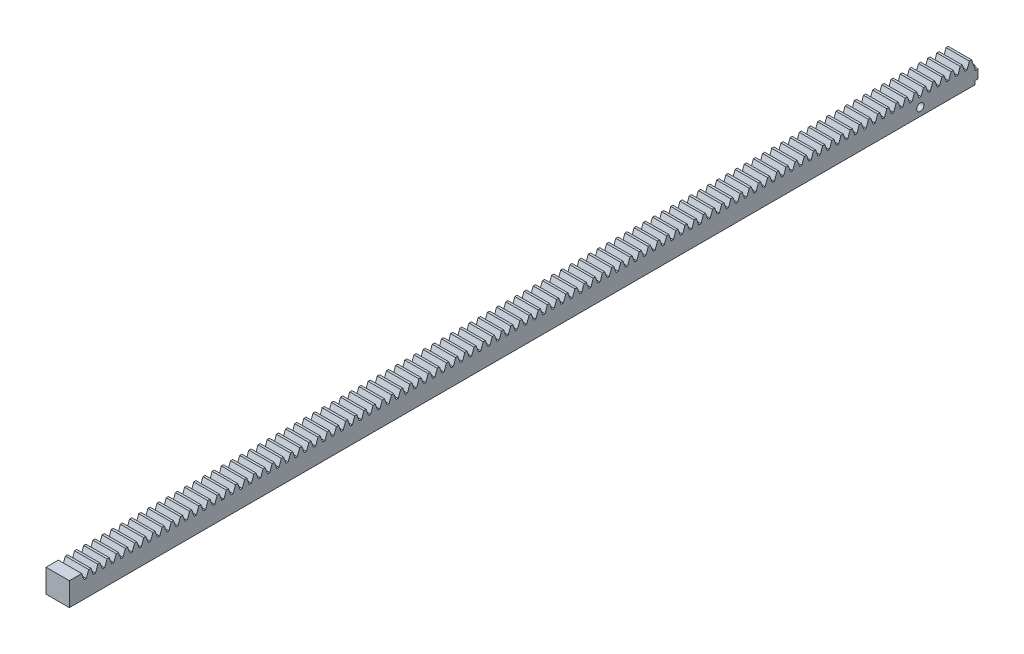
from build123d import *

# Parameters (mm, degrees)
ESQUISSE1_W                = 8
ESQUISSE1_H                = 8
BASE_EXTRUSION_DEPTH       = 310
ENL_V_MAT_EXTRU_1_DEPTH    = 311.206382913
R_P_TITION_LIN_AIRE1_COUNT = 98
R_P_TITION_LIN_AIRE1_PITCH = 3.14
TROU_TARAUD_M3X0_51_D      = 2.5
ESQUISSE5_W                = 8
ESQUISSE5_H                = 3
BOSS_EXTRU_1_DEPTH         = 1


with BuildPart() as part:
    # Esquisse1 → Base-Extrusion (new body)
    with BuildSketch(Plane.XY):
        with Locations((4, 4)):
            Rectangle(ESQUISSE1_W, ESQUISSE1_H)
    extrude(amount=BASE_EXTRUSION_DEPTH)

    # Esquisse2 → Enl_v. mat.-Extru.1 (cut, through all)
    with BuildSketch(Plane(origin=(0, 0, 0), x_dir=(0, 0, -1), z_dir=(1, 0, 0))):
        Polygon((-1.194466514, 8), (-0.375533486, 5.75), (0.375533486, 5.75), (1.194466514, 8), align=None)
    enl_v_mat_extru_1 = extrude(amount=ENL_V_MAT_EXTRU_1_DEPTH, mode=Mode.SUBTRACT)

    # R_p_tition lin_aire1: Enl_v. mat.-Extru.1 ×98
    with Locations(*[(0, 0, i * R_P_TITION_LIN_AIRE1_PITCH) for i in range(1, R_P_TITION_LIN_AIRE1_COUNT)]):
        add(enl_v_mat_extru_1, mode=Mode.SUBTRACT)

    # Trou taraud_ M3x0.51 (through all)
    with Locations(Plane(origin=(8, 0, 0), x_dir=(0, 0, -1), z_dir=(1, 0, 0))):
        with Locations((-18.74, 2.75)):
            Hole(TROU_TARAUD_M3X0_51_D / 2)

    # Esquisse5 → Boss.-Extru.1 (add)
    with BuildSketch(Plane(origin=(0, 0, 0), x_dir=(-1, 0, 0), z_dir=(0, 0, -1))):
        with Locations((-4, 2.75)):
            Rectangle(ESQUISSE5_W, ESQUISSE5_H)
    extrude(amount=BOSS_EXTRU_1_DEPTH)


solid = part.part
